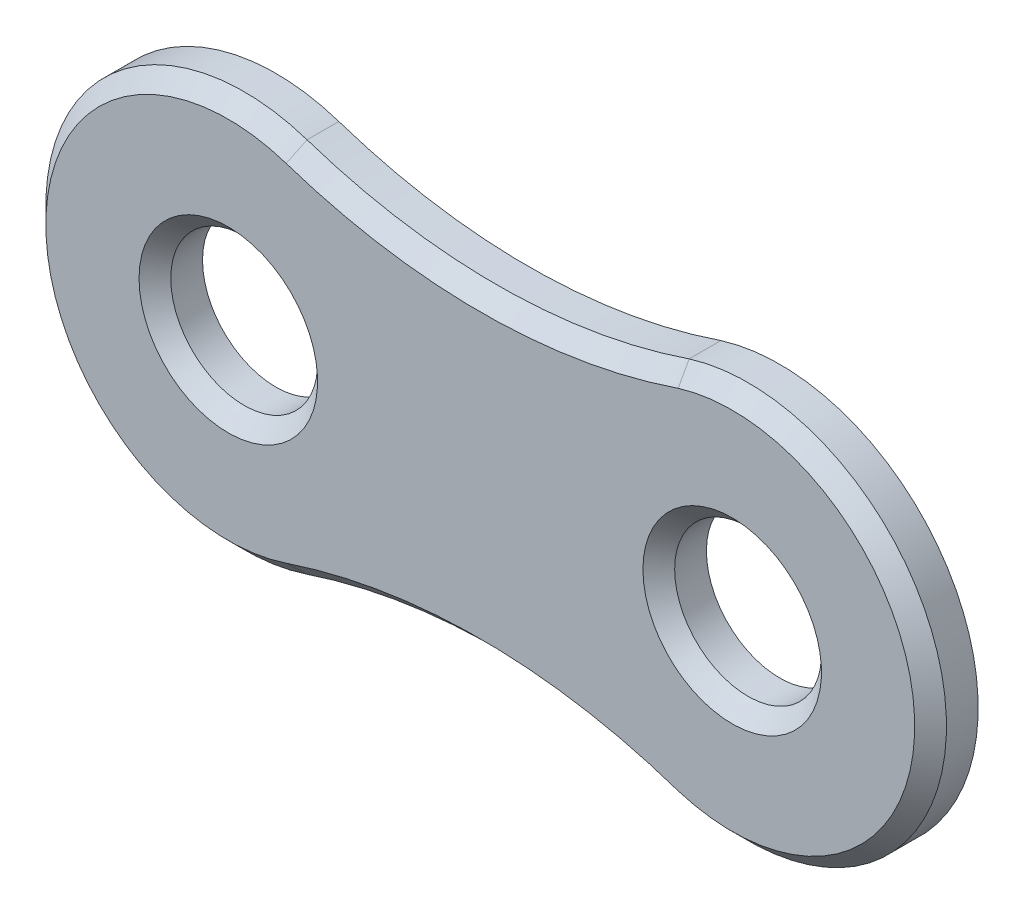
ISO-10303-21;
HEADER;
FILE_DESCRIPTION(('STEP AP214'),'2;1');
FILE_NAME('part.step','',(''),(''),'','','');
FILE_SCHEMA(('AUTOMOTIVE_DESIGN { 1 0 10303 214 1 1 1 1 }'));
ENDSEC;
DATA;
#1=APPLICATION_CONTEXT('core data for automotive mechanical design processes');
#2=APPLICATION_PROTOCOL_DEFINITION('international standard','automotive_design',2000,#1);
#3=PRODUCT_CONTEXT('',#1,'mechanical');
#4=PRODUCT('Part','Part','',(#3));
#5=PRODUCT_RELATED_PRODUCT_CATEGORY('part','',(#4));
#6=PRODUCT_DEFINITION_FORMATION('','',#4);
#7=PRODUCT_DEFINITION_CONTEXT('part definition',#1,'design');
#8=PRODUCT_DEFINITION('design','',#6,#7);
#9=PRODUCT_DEFINITION_SHAPE('','',#8);
#10=(LENGTH_UNIT() NAMED_UNIT(*) SI_UNIT(.MILLI.,.METRE.));
#11=(NAMED_UNIT(*) PLANE_ANGLE_UNIT() SI_UNIT($,.RADIAN.));
#12=(NAMED_UNIT(*) SI_UNIT($,.STERADIAN.) SOLID_ANGLE_UNIT());
#13=UNCERTAINTY_MEASURE_WITH_UNIT(LENGTH_MEASURE(1.E-05),#10,'distance_accuracy_value','');
#14=(GEOMETRIC_REPRESENTATION_CONTEXT(3) GLOBAL_UNCERTAINTY_ASSIGNED_CONTEXT((#13)) GLOBAL_UNIT_ASSIGNED_CONTEXT((#10,
#11,#12)) REPRESENTATION_CONTEXT('',''));
#15=CARTESIAN_POINT('',(0.,0.,0.));
#16=DIRECTION('',(0.,0.,1.));
#17=DIRECTION('',(1.,0.,0.));
#18=AXIS2_PLACEMENT_3D('',#15,#16,#17);
#19=CARTESIAN_POINT('',(-1.58693480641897,4.75074437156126,0.6));
#20=DIRECTION('',(0.,0.,-1.));
#21=DIRECTION('',(-1.,0.,0.));
#22=AXIS2_PLACEMENT_3D('',#19,#20,#21);
#23=PLANE('',#22);
#24=CARTESIAN_POINT('',(3.175,0.,0.6));
#25=DIRECTION('',(0.,0.,-1.));
#26=DIRECTION('',(-1.,0.,0.));
#27=AXIS2_PLACEMENT_3D('',#24,#25,#26);
#28=CIRCLE('',#27,1.125);
#29=CARTESIAN_POINT('',(2.05,0.,0.6));
#30=VERTEX_POINT('',#29);
#31=EDGE_CURVE('E132',#30,#30,#28,.T.);
#32=ORIENTED_EDGE('',*,*,#31,.T.);
#33=EDGE_LOOP('',(#32));
#34=FACE_BOUND('',#33,.T.);
#35=CARTESIAN_POINT('',(0.00113038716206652,-9.50148874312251,0.6));
#36=DIRECTION('',(0.,0.,-1.));
#37=DIRECTION('',(-1.,0.,0.));
#38=AXIS2_PLACEMENT_3D('',#35,#36,#37);
#39=CIRCLE('',#38,7.71828790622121);
#40=CARTESIAN_POINT('',(-2.44582352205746,-2.18135317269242,0.6));
#41=VERTEX_POINT('',#40);
#42=CARTESIAN_POINT('',(2.49425816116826,-2.19695028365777,0.6));
#43=VERTEX_POINT('',#42);
#44=EDGE_CURVE('E127',#41,#43,#39,.T.);
#45=ORIENTED_EDGE('',*,*,#44,.T.);
#46=CARTESIAN_POINT('',(3.175,0.,0.6));
#47=DIRECTION('',(0.,0.,-1.));
#48=DIRECTION('',(-1.,0.,0.));
#49=AXIS2_PLACEMENT_3D('',#46,#47,#48);
#50=CIRCLE('',#49,2.3);
#51=CARTESIAN_POINT('',(2.49425816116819,2.19695028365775,0.6));
#52=VERTEX_POINT('',#51);
#53=EDGE_CURVE('E129',#43,#52,#50,.F.);
#54=ORIENTED_EDGE('',*,*,#53,.T.);
#55=CARTESIAN_POINT('',(0.00113038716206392,9.50148874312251,0.6));
#56=DIRECTION('',(0.,0.,-1.));
#57=DIRECTION('',(-1.,0.,0.));
#58=AXIS2_PLACEMENT_3D('',#55,#56,#57);
#59=CIRCLE('',#58,7.7182879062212);
#60=CARTESIAN_POINT('',(-2.44582352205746,2.18135317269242,0.6));
#61=VERTEX_POINT('',#60);
#62=EDGE_CURVE('E123',#52,#61,#59,.T.);
#63=ORIENTED_EDGE('',*,*,#62,.T.);
#64=CARTESIAN_POINT('',(-3.175,0.,0.6));
#65=DIRECTION('',(0.,0.,-1.));
#66=DIRECTION('',(-1.,0.,0.));
#67=AXIS2_PLACEMENT_3D('',#64,#65,#66);
#68=CIRCLE('',#67,2.3);
#69=EDGE_CURVE('E125',#61,#41,#68,.F.);
#70=ORIENTED_EDGE('',*,*,#69,.T.);
#71=EDGE_LOOP('',(#45,#54,#63,#70));
#72=FACE_BOUND('',#71,.T.);
#73=CARTESIAN_POINT('',(-3.175,0.,0.6));
#74=DIRECTION('',(0.,0.,-1.));
#75=DIRECTION('',(-1.,0.,0.));
#76=AXIS2_PLACEMENT_3D('',#73,#74,#75);
#77=CIRCLE('',#76,1.125);
#78=CARTESIAN_POINT('',(-4.3,0.,0.6));
#79=VERTEX_POINT('',#78);
#80=EDGE_CURVE('E120',#79,#79,#77,.T.);
#81=ORIENTED_EDGE('',*,*,#80,.T.);
#82=EDGE_LOOP('',(#81));
#83=FACE_BOUND('',#82,.T.);
#84=ADVANCED_FACE('F29',(#34,#72,#83),#23,.F.);
#85=CARTESIAN_POINT('',(-1.58693480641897,4.75074437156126,0.));
#86=DIRECTION('',(0.,0.,-1.));
#87=DIRECTION('',(-1.,0.,0.));
#88=AXIS2_PLACEMENT_3D('',#85,#86,#87);
#89=PLANE('',#88);
#90=CARTESIAN_POINT('',(-3.175,0.,0.));
#91=DIRECTION('',(0.,0.,1.));
#92=DIRECTION('',(1.,0.,0.));
#93=AXIS2_PLACEMENT_3D('',#90,#91,#92);
#94=CIRCLE('',#93,0.925);
#95=CARTESIAN_POINT('',(-2.25,0.,0.));
#96=VERTEX_POINT('',#95);
#97=EDGE_CURVE('E104',#96,#96,#94,.T.);
#98=ORIENTED_EDGE('',*,*,#97,.T.);
#99=EDGE_LOOP('',(#98));
#100=FACE_BOUND('',#99,.T.);
#101=CARTESIAN_POINT('',(0.00113038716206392,9.50148874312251,0.));
#102=DIRECTION('',(0.,0.,-1.));
#103=DIRECTION('',(-1.,0.,0.));
#104=AXIS2_PLACEMENT_3D('',#101,#102,#103);
#105=CIRCLE('',#104,7.5182879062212);
#106=CARTESIAN_POINT('',(2.43227268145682,2.38712298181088,0.));
#107=VERTEX_POINT('',#106);
#108=CARTESIAN_POINT('',(-2.38241687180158,2.37103605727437,0.));
#109=VERTEX_POINT('',#108);
#110=EDGE_CURVE('E97',#107,#109,#105,.T.);
#111=ORIENTED_EDGE('',*,*,#110,.F.);
#112=CARTESIAN_POINT('',(3.175,0.,0.));
#113=DIRECTION('',(0.,0.,1.));
#114=DIRECTION('',(-1.,0.,0.));
#115=AXIS2_PLACEMENT_3D('',#112,#113,#114);
#116=CIRCLE('',#115,2.5);
#117=CARTESIAN_POINT('',(2.43227268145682,-2.38712298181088,0.));
#118=VERTEX_POINT('',#117);
#119=EDGE_CURVE('E112',#118,#107,#116,.T.);
#120=ORIENTED_EDGE('',*,*,#119,.F.);
#121=CARTESIAN_POINT('',(0.00113038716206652,-9.50148874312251,0.));
#122=DIRECTION('',(0.,0.,-1.));
#123=DIRECTION('',(1.,0.,0.));
#124=AXIS2_PLACEMENT_3D('',#121,#122,#123);
#125=CIRCLE('',#124,7.5182879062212);
#126=CARTESIAN_POINT('',(-2.38241687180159,-2.37103605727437,0.));
#127=VERTEX_POINT('',#126);
#128=EDGE_CURVE('E99',#127,#118,#125,.T.);
#129=ORIENTED_EDGE('',*,*,#128,.F.);
#130=CARTESIAN_POINT('',(-3.175,0.,0.));
#131=DIRECTION('',(0.,0.,1.));
#132=DIRECTION('',(1.,0.,0.));
#133=AXIS2_PLACEMENT_3D('',#130,#131,#132);
#134=CIRCLE('',#133,2.5);
#135=EDGE_CURVE('E84',#109,#127,#134,.T.);
#136=ORIENTED_EDGE('',*,*,#135,.F.);
#137=EDGE_LOOP('',(#111,#120,#129,#136));
#138=FACE_BOUND('',#137,.T.);
#139=CARTESIAN_POINT('',(3.175,0.,0.));
#140=DIRECTION('',(0.,0.,1.));
#141=DIRECTION('',(-1.,0.,0.));
#142=AXIS2_PLACEMENT_3D('',#139,#140,#141);
#143=CIRCLE('',#142,0.925000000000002);
#144=CARTESIAN_POINT('',(2.25,0.,0.));
#145=VERTEX_POINT('',#144);
#146=EDGE_CURVE('E107',#145,#145,#143,.T.);
#147=ORIENTED_EDGE('',*,*,#146,.T.);
#148=EDGE_LOOP('',(#147));
#149=FACE_BOUND('',#148,.T.);
#150=ADVANCED_FACE('F94',(#100,#138,#149),#89,.T.);
#151=CARTESIAN_POINT('',(0.00113038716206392,9.50148874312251,0.6));
#152=DIRECTION('',(0.,0.,-1.));
#153=DIRECTION('',(-1.,0.,0.));
#154=AXIS2_PLACEMENT_3D('',#151,#152,#153);
#155=CYLINDRICAL_SURFACE('',#154,7.5182879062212);
#156=DIRECTION('',(0.,0.,-1.));
#157=VECTOR('',#156,1.);
#158=CARTESIAN_POINT('',(-2.38241687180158,2.37103605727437,0.6));
#159=LINE('',#158,#157);
#160=CARTESIAN_POINT('',(-2.38241687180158,2.37103605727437,0.399999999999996));
#161=VERTEX_POINT('',#160);
#162=EDGE_CURVE('E81',#161,#109,#159,.T.);
#163=ORIENTED_EDGE('',*,*,#162,.F.);
#164=CARTESIAN_POINT('',(0.00113038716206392,9.50148874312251,0.399999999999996));
#165=DIRECTION('',(0.,0.,-1.));
#166=DIRECTION('',(-1.,0.,0.));
#167=AXIS2_PLACEMENT_3D('',#164,#165,#166);
#168=CIRCLE('',#167,7.5182879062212);
#169=CARTESIAN_POINT('',(2.43227268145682,2.38712298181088,0.399999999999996));
#170=VERTEX_POINT('',#169);
#171=EDGE_CURVE('E37',#161,#170,#168,.F.);
#172=ORIENTED_EDGE('',*,*,#171,.T.);
#173=DIRECTION('',(0.,0.,-1.));
#174=VECTOR('',#173,1.);
#175=CARTESIAN_POINT('',(2.43227268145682,2.38712298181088,0.6));
#176=LINE('',#175,#174);
#177=EDGE_CURVE('E102',#170,#107,#176,.T.);
#178=ORIENTED_EDGE('',*,*,#177,.T.);
#179=ORIENTED_EDGE('',*,*,#110,.T.);
#180=EDGE_LOOP('',(#163,#172,#178,#179));
#181=FACE_BOUND('',#180,.T.);
#182=ADVANCED_FACE('F31',(#181),#155,.F.);
#183=CARTESIAN_POINT('',(-3.175,0.,0.6));
#184=DIRECTION('',(0.,0.,-1.));
#185=DIRECTION('',(-1.,0.,0.));
#186=AXIS2_PLACEMENT_3D('',#183,#184,#185);
#187=CYLINDRICAL_SURFACE('',#186,2.5);
#188=DIRECTION('',(0.,0.,-1.));
#189=VECTOR('',#188,1.);
#190=CARTESIAN_POINT('',(-2.38241687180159,-2.37103605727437,0.6));
#191=LINE('',#190,#189);
#192=CARTESIAN_POINT('',(-2.38241687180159,-2.37103605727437,0.399999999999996));
#193=VERTEX_POINT('',#192);
#194=EDGE_CURVE('E90',#193,#127,#191,.T.);
#195=ORIENTED_EDGE('',*,*,#194,.F.);
#196=CARTESIAN_POINT('',(-3.175,0.,0.399999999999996));
#197=DIRECTION('',(0.,0.,-1.));
#198=DIRECTION('',(-1.,0.,0.));
#199=AXIS2_PLACEMENT_3D('',#196,#197,#198);
#200=CIRCLE('',#199,2.5);
#201=EDGE_CURVE('E44',#193,#161,#200,.T.);
#202=ORIENTED_EDGE('',*,*,#201,.T.);
#203=ORIENTED_EDGE('',*,*,#162,.T.);
#204=ORIENTED_EDGE('',*,*,#135,.T.);
#205=EDGE_LOOP('',(#195,#202,#203,#204));
#206=FACE_BOUND('',#205,.T.);
#207=ADVANCED_FACE('F83',(#206),#187,.T.);
#208=CARTESIAN_POINT('',(0.00113038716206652,-9.50148874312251,0.6));
#209=DIRECTION('',(0.,0.,-1.));
#210=DIRECTION('',(-1.,0.,0.));
#211=AXIS2_PLACEMENT_3D('',#208,#209,#210);
#212=CYLINDRICAL_SURFACE('',#211,7.5182879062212);
#213=DIRECTION('',(0.,0.,-1.));
#214=VECTOR('',#213,1.);
#215=CARTESIAN_POINT('',(2.43227268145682,-2.38712298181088,0.6));
#216=LINE('',#215,#214);
#217=CARTESIAN_POINT('',(2.43227268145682,-2.38712298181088,0.399999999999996));
#218=VERTEX_POINT('',#217);
#219=EDGE_CURVE('E115',#218,#118,#216,.T.);
#220=ORIENTED_EDGE('',*,*,#219,.F.);
#221=CARTESIAN_POINT('',(0.00113038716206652,-9.50148874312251,0.399999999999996));
#222=DIRECTION('',(0.,0.,-1.));
#223=DIRECTION('',(-1.,0.,0.));
#224=AXIS2_PLACEMENT_3D('',#221,#222,#223);
#225=CIRCLE('',#224,7.5182879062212);
#226=EDGE_CURVE('E52',#218,#193,#225,.F.);
#227=ORIENTED_EDGE('',*,*,#226,.T.);
#228=ORIENTED_EDGE('',*,*,#194,.T.);
#229=ORIENTED_EDGE('',*,*,#128,.T.);
#230=EDGE_LOOP('',(#220,#227,#228,#229));
#231=FACE_BOUND('',#230,.T.);
#232=ADVANCED_FACE('F202',(#231),#212,.F.);
#233=CARTESIAN_POINT('',(3.175,0.,0.6));
#234=DIRECTION('',(0.,0.,-1.));
#235=DIRECTION('',(-1.,0.,0.));
#236=AXIS2_PLACEMENT_3D('',#233,#234,#235);
#237=CYLINDRICAL_SURFACE('',#236,2.5);
#238=ORIENTED_EDGE('',*,*,#177,.F.);
#239=CARTESIAN_POINT('',(3.175,0.,0.399999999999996));
#240=DIRECTION('',(0.,0.,-1.));
#241=DIRECTION('',(-1.,0.,0.));
#242=AXIS2_PLACEMENT_3D('',#239,#240,#241);
#243=CIRCLE('',#242,2.5);
#244=EDGE_CURVE('E135',#170,#218,#243,.T.);
#245=ORIENTED_EDGE('',*,*,#244,.T.);
#246=ORIENTED_EDGE('',*,*,#219,.T.);
#247=ORIENTED_EDGE('',*,*,#119,.T.);
#248=EDGE_LOOP('',(#238,#245,#246,#247));
#249=FACE_BOUND('',#248,.T.);
#250=ADVANCED_FACE('F145',(#249),#237,.T.);
#251=CARTESIAN_POINT('',(-3.175,0.,0.6));
#252=DIRECTION('',(0.,0.,-1.));
#253=DIRECTION('',(-1.,0.,0.));
#254=AXIS2_PLACEMENT_3D('',#251,#252,#253);
#255=CYLINDRICAL_SURFACE('',#254,0.925);
#256=CARTESIAN_POINT('',(-3.175,0.,0.399999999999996));
#257=DIRECTION('',(0.,0.,-1.));
#258=DIRECTION('',(-1.,0.,0.));
#259=AXIS2_PLACEMENT_3D('',#256,#257,#258);
#260=CIRCLE('',#259,0.925);
#261=CARTESIAN_POINT('',(-4.1,0.,0.399999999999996));
#262=VERTEX_POINT('',#261);
#263=EDGE_CURVE('E11',#262,#262,#260,.F.);
#264=ORIENTED_EDGE('',*,*,#263,.T.);
#265=EDGE_LOOP('',(#264));
#266=FACE_BOUND('',#265,.T.);
#267=ORIENTED_EDGE('',*,*,#97,.F.);
#268=EDGE_LOOP('',(#267));
#269=FACE_BOUND('',#268,.T.);
#270=ADVANCED_FACE('F189',(#266,#269),#255,.F.);
#271=CARTESIAN_POINT('',(3.175,0.,0.6));
#272=DIRECTION('',(0.,0.,-1.));
#273=DIRECTION('',(-1.,0.,0.));
#274=AXIS2_PLACEMENT_3D('',#271,#272,#273);
#275=CYLINDRICAL_SURFACE('',#274,0.925000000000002);
#276=CARTESIAN_POINT('',(3.175,0.,0.399999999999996));
#277=DIRECTION('',(0.,0.,-1.));
#278=DIRECTION('',(-1.,0.,0.));
#279=AXIS2_PLACEMENT_3D('',#276,#277,#278);
#280=CIRCLE('',#279,0.925000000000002);
#281=CARTESIAN_POINT('',(2.25,0.,0.399999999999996));
#282=VERTEX_POINT('',#281);
#283=EDGE_CURVE('E89',#282,#282,#280,.F.);
#284=ORIENTED_EDGE('',*,*,#283,.T.);
#285=EDGE_LOOP('',(#284));
#286=FACE_BOUND('',#285,.T.);
#287=ORIENTED_EDGE('',*,*,#146,.F.);
#288=EDGE_LOOP('',(#287));
#289=FACE_BOUND('',#288,.T.);
#290=ADVANCED_FACE('F185',(#286,#289),#275,.F.);
#291=CARTESIAN_POINT('',(3.175,0.,0.399999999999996));
#292=DIRECTION('',(0.,0.,1.));
#293=DIRECTION('',(1.,0.,0.));
#294=AXIS2_PLACEMENT_3D('',#291,#292,#293);
#295=CONICAL_SURFACE('',#294,0.925000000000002,0.785398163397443);
#296=ORIENTED_EDGE('',*,*,#31,.F.);
#297=EDGE_LOOP('',(#296));
#298=FACE_BOUND('',#297,.T.);
#299=ORIENTED_EDGE('',*,*,#283,.F.);
#300=EDGE_LOOP('',(#299));
#301=FACE_BOUND('',#300,.T.);
#302=ADVANCED_FACE('F181',(#298,#301),#295,.F.);
#303=CARTESIAN_POINT('',(-3.175,0.,0.6));
#304=DIRECTION('',(0.,0.,-1.));
#305=DIRECTION('',(-1.,0.,0.));
#306=AXIS2_PLACEMENT_3D('',#303,#304,#305);
#307=CONICAL_SURFACE('',#306,2.3,0.785398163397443);
#308=DIRECTION('',(-0.224176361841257,-0.670630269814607,0.707106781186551));
#309=VECTOR('',#308,1.);
#310=CARTESIAN_POINT('',(-2.38241687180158,2.37103605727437,0.399999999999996));
#311=LINE('',#310,#309);
#312=EDGE_CURVE('E155',#161,#61,#311,.T.);
#313=ORIENTED_EDGE('',*,*,#312,.F.);
#314=ORIENTED_EDGE('',*,*,#201,.F.);
#315=DIRECTION('',(0.224176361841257,-0.670630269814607,-0.707106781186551));
#316=VECTOR('',#315,1.);
#317=CARTESIAN_POINT('',(-2.44582352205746,-2.18135317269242,0.6));
#318=LINE('',#317,#316);
#319=EDGE_CURVE('E302',#41,#193,#318,.T.);
#320=ORIENTED_EDGE('',*,*,#319,.F.);
#321=ORIENTED_EDGE('',*,*,#69,.F.);
#322=EDGE_LOOP('',(#313,#314,#320,#321));
#323=FACE_BOUND('',#322,.T.);
#324=ADVANCED_FACE('F177',(#323),#307,.T.);
#325=CARTESIAN_POINT('',(0.00113038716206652,-9.50148874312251,0.6));
#326=DIRECTION('',(0.,0.,1.));
#327=DIRECTION('',(1.,0.,0.));
#328=AXIS2_PLACEMENT_3D('',#325,#326,#327);
#329=CONICAL_SURFACE('',#328,7.71828790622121,0.785398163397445);
#330=ORIENTED_EDGE('',*,*,#319,.T.);
#331=ORIENTED_EDGE('',*,*,#226,.F.);
#332=CARTESIAN_POINT('',(2.43227268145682,-2.38712298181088,0.399999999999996));
#333=CARTESIAN_POINT('',(2.44261575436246,-2.35543154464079,0.433333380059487));
#334=CARTESIAN_POINT('',(2.45295274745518,-2.323738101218,0.466666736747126));
#335=CARTESIAN_POINT('',(2.47361457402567,-2.26034720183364,0.533333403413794));
#336=CARTESIAN_POINT('',(2.48393940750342,-2.22864974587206,0.566666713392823));
#337=CARTESIAN_POINT('',(2.49425816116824,-2.19695028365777,0.6));
#338=B_SPLINE_CURVE_WITH_KNOTS('',3,(#332,#333,#334,#335,#336,#337),.UNSPECIFIED.,.F.,.F.,(4,2,
4),(0.,0.141428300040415,0.282856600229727),.UNSPECIFIED.);
#339=EDGE_CURVE('E152',#43,#218,#338,.F.);
#340=ORIENTED_EDGE('',*,*,#339,.F.);
#341=ORIENTED_EDGE('',*,*,#44,.F.);
#342=EDGE_LOOP('',(#330,#331,#340,#341));
#343=FACE_BOUND('',#342,.T.);
#344=ADVANCED_FACE('F172',(#343),#329,.F.);
#345=CARTESIAN_POINT('',(0.00113038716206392,9.50148874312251,0.6));
#346=DIRECTION('',(0.,0.,1.));
#347=DIRECTION('',(1.,0.,0.));
#348=AXIS2_PLACEMENT_3D('',#345,#346,#347);
#349=CONICAL_SURFACE('',#348,7.7182879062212,0.785398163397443);
#350=ORIENTED_EDGE('',*,*,#312,.T.);
#351=ORIENTED_EDGE('',*,*,#62,.F.);
#352=CARTESIAN_POINT('',(2.49425816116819,2.19695028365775,0.6));
#353=CARTESIAN_POINT('',(2.48393940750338,2.22864974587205,0.566666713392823));
#354=CARTESIAN_POINT('',(2.47361457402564,2.26034720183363,0.533333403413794));
#355=CARTESIAN_POINT('',(2.45295274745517,2.323738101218,0.466666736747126));
#356=CARTESIAN_POINT('',(2.44261575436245,2.35543154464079,0.433333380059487));
#357=CARTESIAN_POINT('',(2.43227268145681,2.38712298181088,0.399999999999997));
#358=B_SPLINE_CURVE_WITH_KNOTS('',3,(#352,#353,#354,#355,#356,#357),.UNSPECIFIED.,.F.,.F.,(4,2,
4),(0.,0.141428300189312,0.282856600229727),.UNSPECIFIED.);
#359=EDGE_CURVE('E149',#170,#52,#358,.F.);
#360=ORIENTED_EDGE('',*,*,#359,.F.);
#361=ORIENTED_EDGE('',*,*,#171,.F.);
#362=EDGE_LOOP('',(#350,#351,#360,#361));
#363=FACE_BOUND('',#362,.T.);
#364=ADVANCED_FACE('F153',(#363),#349,.F.);
#365=CARTESIAN_POINT('',(3.175,0.,0.6));
#366=DIRECTION('',(0.,0.,-1.));
#367=DIRECTION('',(-1.,0.,0.));
#368=AXIS2_PLACEMENT_3D('',#365,#366,#367);
#369=CONICAL_SURFACE('',#368,2.3,0.785398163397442);
#370=ORIENTED_EDGE('',*,*,#339,.T.);
#371=ORIENTED_EDGE('',*,*,#244,.F.);
#372=ORIENTED_EDGE('',*,*,#359,.T.);
#373=ORIENTED_EDGE('',*,*,#53,.F.);
#374=EDGE_LOOP('',(#370,#371,#372,#373));
#375=FACE_BOUND('',#374,.T.);
#376=ADVANCED_FACE('F147',(#375),#369,.T.);
#377=CARTESIAN_POINT('',(-3.175,0.,0.399999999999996));
#378=DIRECTION('',(0.,0.,1.));
#379=DIRECTION('',(1.,0.,0.));
#380=AXIS2_PLACEMENT_3D('',#377,#378,#379);
#381=CONICAL_SURFACE('',#380,0.925,0.785398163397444);
#382=ORIENTED_EDGE('',*,*,#80,.F.);
#383=EDGE_LOOP('',(#382));
#384=FACE_BOUND('',#383,.T.);
#385=ORIENTED_EDGE('',*,*,#263,.F.);
#386=EDGE_LOOP('',(#385));
#387=FACE_BOUND('',#386,.T.);
#388=ADVANCED_FACE('F171',(#384,#387),#381,.F.);
#389=CLOSED_SHELL('',(#84,#150,#182,#207,#232,#250,#270,#290,#302,#324,#344,#364,#376,#388));
#390=MANIFOLD_SOLID_BREP('B2',#389);
#391=ADVANCED_BREP_SHAPE_REPRESENTATION('',(#18,#390),#14);
#392=SHAPE_DEFINITION_REPRESENTATION(#9,#391);
ENDSEC;
END-ISO-10303-21;
